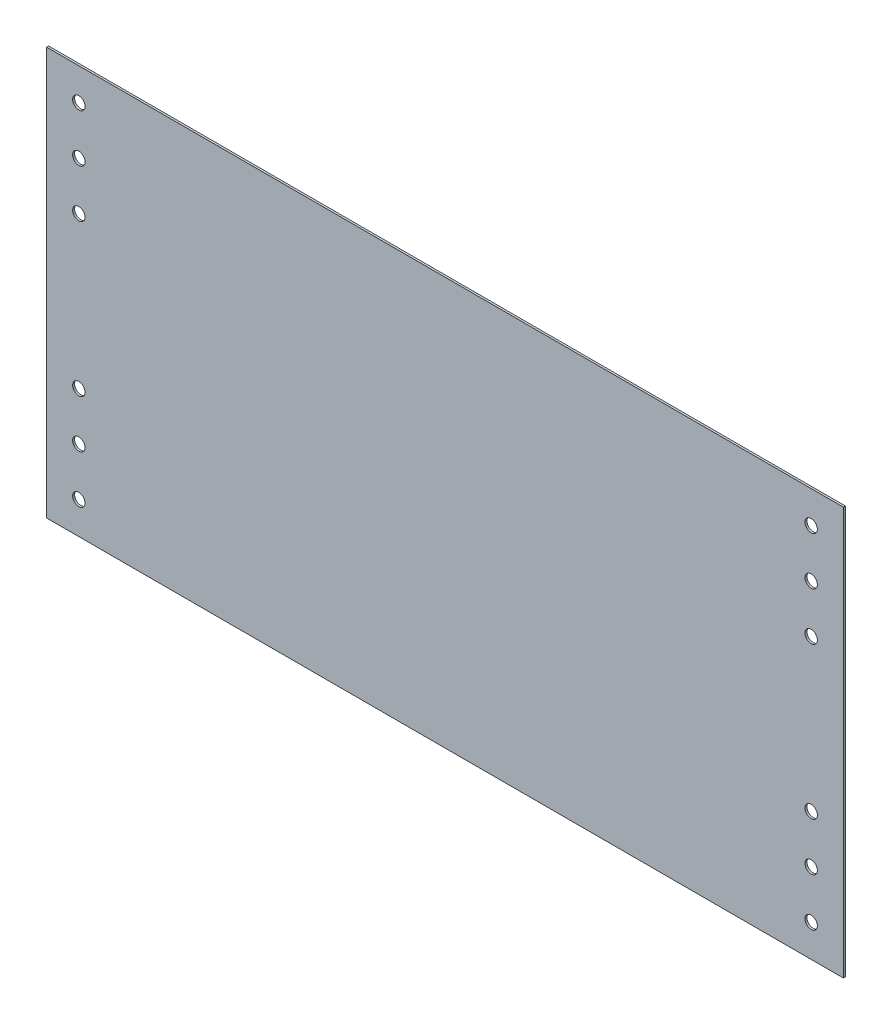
ISO-10303-21;
HEADER;
FILE_DESCRIPTION(('STEP AP214'),'2;1');
FILE_NAME('part.step','',(''),(''),'','','');
FILE_SCHEMA(('AUTOMOTIVE_DESIGN { 1 0 10303 214 1 1 1 1 }'));
ENDSEC;
DATA;
#1=APPLICATION_CONTEXT('core data for automotive mechanical design processes');
#2=APPLICATION_PROTOCOL_DEFINITION('international standard','automotive_design',2000,#1);
#3=PRODUCT_CONTEXT('',#1,'mechanical');
#4=PRODUCT('Part','Part','',(#3));
#5=PRODUCT_RELATED_PRODUCT_CATEGORY('part','',(#4));
#6=PRODUCT_DEFINITION_FORMATION('','',#4);
#7=PRODUCT_DEFINITION_CONTEXT('part definition',#1,'design');
#8=PRODUCT_DEFINITION('design','',#6,#7);
#9=PRODUCT_DEFINITION_SHAPE('','',#8);
#10=(LENGTH_UNIT() NAMED_UNIT(*) SI_UNIT(.MILLI.,.METRE.));
#11=(NAMED_UNIT(*) PLANE_ANGLE_UNIT() SI_UNIT($,.RADIAN.));
#12=(NAMED_UNIT(*) SI_UNIT($,.STERADIAN.) SOLID_ANGLE_UNIT());
#13=UNCERTAINTY_MEASURE_WITH_UNIT(LENGTH_MEASURE(1.E-05),#10,'distance_accuracy_value','');
#14=(GEOMETRIC_REPRESENTATION_CONTEXT(3) GLOBAL_UNCERTAINTY_ASSIGNED_CONTEXT((#13)) GLOBAL_UNIT_ASSIGNED_CONTEXT((#10,
#11,#12)) REPRESENTATION_CONTEXT('',''));
#15=CARTESIAN_POINT('',(0.,0.,0.));
#16=DIRECTION('',(0.,0.,1.));
#17=DIRECTION('',(1.,0.,0.));
#18=AXIS2_PLACEMENT_3D('',#15,#16,#17);
#19=CARTESIAN_POINT('',(-314.599113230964,343.044444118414,1.5875));
#20=DIRECTION('',(1.,0.,0.));
#21=DIRECTION('',(0.,1.,0.));
#22=AXIS2_PLACEMENT_3D('',#19,#20,#21);
#23=PLANE('',#22);
#24=DIRECTION('',(0.,-1.,0.));
#25=VECTOR('',#24,1.);
#26=CARTESIAN_POINT('',(-314.599113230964,343.044444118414,0.));
#27=LINE('',#26,#25);
#28=CARTESIAN_POINT('',(-314.599113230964,343.044444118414,0.));
#29=VERTEX_POINT('',#28);
#30=CARTESIAN_POINT('',(-314.599113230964,20.955,0.));
#31=VERTEX_POINT('',#30);
#32=EDGE_CURVE('E95',#29,#31,#27,.T.);
#33=ORIENTED_EDGE('',*,*,#32,.T.);
#34=DIRECTION('',(0.,0.,-1.));
#35=VECTOR('',#34,1.);
#36=CARTESIAN_POINT('',(-314.599113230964,20.955,1.5875));
#37=LINE('',#36,#35);
#38=CARTESIAN_POINT('',(-314.599113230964,20.955,1.5875));
#39=VERTEX_POINT('',#38);
#40=EDGE_CURVE('E11',#39,#31,#37,.T.);
#41=ORIENTED_EDGE('',*,*,#40,.F.);
#42=DIRECTION('',(0.,-1.,0.));
#43=VECTOR('',#42,1.);
#44=CARTESIAN_POINT('',(-314.599113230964,343.044444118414,1.5875));
#45=LINE('',#44,#43);
#46=CARTESIAN_POINT('',(-314.599113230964,343.044444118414,1.5875));
#47=VERTEX_POINT('',#46);
#48=EDGE_CURVE('E83',#47,#39,#45,.T.);
#49=ORIENTED_EDGE('',*,*,#48,.F.);
#50=DIRECTION('',(0.,0.,-1.));
#51=VECTOR('',#50,1.);
#52=CARTESIAN_POINT('',(-314.599113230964,343.044444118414,1.5875));
#53=LINE('',#52,#51);
#54=EDGE_CURVE('E91',#47,#29,#53,.T.);
#55=ORIENTED_EDGE('',*,*,#54,.T.);
#56=EDGE_LOOP('',(#33,#41,#49,#55));
#57=FACE_BOUND('',#56,.T.);
#58=ADVANCED_FACE('F32',(#57),#23,.F.);
#59=CARTESIAN_POINT('',(-314.599113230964,20.955,1.5875));
#60=DIRECTION('',(0.,1.,0.));
#61=DIRECTION('',(0.,0.,1.));
#62=AXIS2_PLACEMENT_3D('',#59,#60,#61);
#63=PLANE('',#62);
#64=DIRECTION('',(1.,0.,0.));
#65=VECTOR('',#64,1.);
#66=CARTESIAN_POINT('',(-314.599113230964,20.955,0.));
#67=LINE('',#66,#65);
#68=CARTESIAN_POINT('',(314.599113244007,20.955,0.));
#69=VERTEX_POINT('',#68);
#70=EDGE_CURVE('E87',#31,#69,#67,.T.);
#71=ORIENTED_EDGE('',*,*,#70,.T.);
#72=DIRECTION('',(0.,0.,-1.));
#73=VECTOR('',#72,1.);
#74=CARTESIAN_POINT('',(314.599113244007,20.955,1.5875));
#75=LINE('',#74,#73);
#76=CARTESIAN_POINT('',(314.599113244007,20.955,1.5875));
#77=VERTEX_POINT('',#76);
#78=EDGE_CURVE('E40',#77,#69,#75,.T.);
#79=ORIENTED_EDGE('',*,*,#78,.F.);
#80=DIRECTION('',(1.,0.,0.));
#81=VECTOR('',#80,1.);
#82=CARTESIAN_POINT('',(-314.599113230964,20.955,1.5875));
#83=LINE('',#82,#81);
#84=EDGE_CURVE('E78',#39,#77,#83,.T.);
#85=ORIENTED_EDGE('',*,*,#84,.F.);
#86=ORIENTED_EDGE('',*,*,#40,.T.);
#87=EDGE_LOOP('',(#71,#79,#85,#86));
#88=FACE_BOUND('',#87,.T.);
#89=ADVANCED_FACE('F86',(#88),#63,.F.);
#90=CARTESIAN_POINT('',(314.599113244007,343.044444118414,1.5875));
#91=DIRECTION('',(-1.,0.,0.));
#92=DIRECTION('',(0.,-1.,0.));
#93=AXIS2_PLACEMENT_3D('',#90,#91,#92);
#94=PLANE('',#93);
#95=DIRECTION('',(0.,1.,0.));
#96=VECTOR('',#95,1.);
#97=CARTESIAN_POINT('',(314.599113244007,343.044444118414,0.));
#98=LINE('',#97,#96);
#99=CARTESIAN_POINT('',(314.599113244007,343.044444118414,0.));
#100=VERTEX_POINT('',#99);
#101=EDGE_CURVE('E65',#69,#100,#98,.T.);
#102=ORIENTED_EDGE('',*,*,#101,.T.);
#103=DIRECTION('',(0.,0.,-1.));
#104=VECTOR('',#103,1.);
#105=CARTESIAN_POINT('',(314.599113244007,343.044444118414,1.5875));
#106=LINE('',#105,#104);
#107=CARTESIAN_POINT('',(314.599113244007,343.044444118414,1.5875));
#108=VERTEX_POINT('',#107);
#109=EDGE_CURVE('E88',#108,#100,#106,.T.);
#110=ORIENTED_EDGE('',*,*,#109,.F.);
#111=DIRECTION('',(0.,1.,0.));
#112=VECTOR('',#111,1.);
#113=CARTESIAN_POINT('',(314.599113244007,343.044444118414,1.5875));
#114=LINE('',#113,#112);
#115=EDGE_CURVE('E81',#77,#108,#114,.T.);
#116=ORIENTED_EDGE('',*,*,#115,.F.);
#117=ORIENTED_EDGE('',*,*,#78,.T.);
#118=EDGE_LOOP('',(#102,#110,#116,#117));
#119=FACE_BOUND('',#118,.T.);
#120=ADVANCED_FACE('F89',(#119),#94,.F.);
#121=CARTESIAN_POINT('',(-314.599113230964,343.044444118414,1.5875));
#122=DIRECTION('',(0.,-1.,0.));
#123=DIRECTION('',(0.,0.,-1.));
#124=AXIS2_PLACEMENT_3D('',#121,#122,#123);
#125=PLANE('',#124);
#126=DIRECTION('',(-1.,0.,0.));
#127=VECTOR('',#126,1.);
#128=CARTESIAN_POINT('',(-314.599113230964,343.044444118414,0.));
#129=LINE('',#128,#127);
#130=EDGE_CURVE('E71',#100,#29,#129,.T.);
#131=ORIENTED_EDGE('',*,*,#130,.T.);
#132=ORIENTED_EDGE('',*,*,#54,.F.);
#133=DIRECTION('',(-1.,0.,0.));
#134=VECTOR('',#133,1.);
#135=CARTESIAN_POINT('',(-314.599113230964,343.044444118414,1.5875));
#136=LINE('',#135,#134);
#137=EDGE_CURVE('E48',#108,#47,#136,.T.);
#138=ORIENTED_EDGE('',*,*,#137,.F.);
#139=ORIENTED_EDGE('',*,*,#109,.T.);
#140=EDGE_LOOP('',(#131,#132,#138,#139));
#141=FACE_BOUND('',#140,.T.);
#142=ADVANCED_FACE('F103',(#141),#125,.F.);
#143=CARTESIAN_POINT('',(0.,0.,1.5875));
#144=DIRECTION('',(0.,0.,1.));
#145=DIRECTION('',(1.,0.,0.));
#146=AXIS2_PLACEMENT_3D('',#143,#144,#145);
#147=PLANE('',#146);
#148=CARTESIAN_POINT('',(-289.199113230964,46.355,1.5875));
#149=DIRECTION('',(0.,0.,1.));
#150=DIRECTION('',(1.,0.,0.));
#151=AXIS2_PLACEMENT_3D('',#148,#149,#150);
#152=CIRCLE('',#151,4.9022);
#153=CARTESIAN_POINT('',(-284.296913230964,46.355,1.5875));
#154=VERTEX_POINT('',#153);
#155=EDGE_CURVE('E142',#154,#154,#152,.T.);
#156=ORIENTED_EDGE('',*,*,#155,.F.);
#157=EDGE_LOOP('',(#156));
#158=FACE_BOUND('',#157,.T.);
#159=CARTESIAN_POINT('',(-289.199113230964,84.2544736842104,1.5875));
#160=DIRECTION('',(0.,0.,1.));
#161=DIRECTION('',(1.,0.,0.));
#162=AXIS2_PLACEMENT_3D('',#159,#160,#161);
#163=CIRCLE('',#162,4.9022);
#164=CARTESIAN_POINT('',(-284.296913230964,84.2544736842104,1.5875));
#165=VERTEX_POINT('',#164);
#166=EDGE_CURVE('E149',#165,#165,#163,.T.);
#167=ORIENTED_EDGE('',*,*,#166,.F.);
#168=EDGE_LOOP('',(#167));
#169=FACE_BOUND('',#168,.T.);
#170=CARTESIAN_POINT('',(-289.199113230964,122.153947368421,1.5875));
#171=DIRECTION('',(0.,0.,1.));
#172=DIRECTION('',(1.,0.,0.));
#173=AXIS2_PLACEMENT_3D('',#170,#171,#172);
#174=CIRCLE('',#173,4.9022);
#175=CARTESIAN_POINT('',(-284.296913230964,122.153947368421,1.5875));
#176=VERTEX_POINT('',#175);
#177=EDGE_CURVE('E155',#176,#176,#174,.T.);
#178=ORIENTED_EDGE('',*,*,#177,.F.);
#179=EDGE_LOOP('',(#178));
#180=FACE_BOUND('',#179,.T.);
#181=CARTESIAN_POINT('',(289.199113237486,241.845496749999,1.5875));
#182=DIRECTION('',(0.,0.,1.));
#183=DIRECTION('',(1.,0.,0.));
#184=AXIS2_PLACEMENT_3D('',#181,#182,#183);
#185=CIRCLE('',#184,4.9022);
#186=CARTESIAN_POINT('',(294.101313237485,241.845496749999,1.5875));
#187=VERTEX_POINT('',#186);
#188=EDGE_CURVE('E119',#187,#187,#185,.T.);
#189=ORIENTED_EDGE('',*,*,#188,.F.);
#190=EDGE_LOOP('',(#189));
#191=FACE_BOUND('',#190,.T.);
#192=CARTESIAN_POINT('',(289.199113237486,279.74497043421,1.5875));
#193=DIRECTION('',(0.,0.,1.));
#194=DIRECTION('',(1.,0.,0.));
#195=AXIS2_PLACEMENT_3D('',#192,#193,#194);
#196=CIRCLE('',#195,4.9022);
#197=CARTESIAN_POINT('',(294.101313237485,279.74497043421,1.5875));
#198=VERTEX_POINT('',#197);
#199=EDGE_CURVE('E118',#198,#198,#196,.T.);
#200=ORIENTED_EDGE('',*,*,#199,.F.);
#201=EDGE_LOOP('',(#200));
#202=FACE_BOUND('',#201,.T.);
#203=CARTESIAN_POINT('',(289.199113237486,317.64444411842,1.5875));
#204=DIRECTION('',(0.,0.,1.));
#205=DIRECTION('',(1.,0.,0.));
#206=AXIS2_PLACEMENT_3D('',#203,#204,#205);
#207=CIRCLE('',#206,4.9022);
#208=CARTESIAN_POINT('',(294.101313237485,317.64444411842,1.5875));
#209=VERTEX_POINT('',#208);
#210=EDGE_CURVE('E125',#209,#209,#207,.T.);
#211=ORIENTED_EDGE('',*,*,#210,.F.);
#212=EDGE_LOOP('',(#211));
#213=FACE_BOUND('',#212,.T.);
#214=CARTESIAN_POINT('',(-289.199113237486,241.845496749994,1.5875));
#215=DIRECTION('',(0.,0.,1.));
#216=DIRECTION('',(1.,0.,0.));
#217=AXIS2_PLACEMENT_3D('',#214,#215,#216);
#218=CIRCLE('',#217,4.9022);
#219=CARTESIAN_POINT('',(-284.296913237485,241.845496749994,1.5875));
#220=VERTEX_POINT('',#219);
#221=EDGE_CURVE('E131',#220,#220,#218,.T.);
#222=ORIENTED_EDGE('',*,*,#221,.F.);
#223=EDGE_LOOP('',(#222));
#224=FACE_BOUND('',#223,.T.);
#225=CARTESIAN_POINT('',(-289.199113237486,279.744970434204,1.5875));
#226=DIRECTION('',(0.,0.,1.));
#227=DIRECTION('',(1.,0.,0.));
#228=AXIS2_PLACEMENT_3D('',#225,#226,#227);
#229=CIRCLE('',#228,4.9022);
#230=CARTESIAN_POINT('',(-284.296913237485,279.744970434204,1.5875));
#231=VERTEX_POINT('',#230);
#232=EDGE_CURVE('E112',#231,#231,#229,.T.);
#233=ORIENTED_EDGE('',*,*,#232,.F.);
#234=EDGE_LOOP('',(#233));
#235=FACE_BOUND('',#234,.T.);
#236=CARTESIAN_POINT('',(289.199113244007,122.153947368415,1.5875));
#237=DIRECTION('',(0.,0.,1.));
#238=DIRECTION('',(1.,0.,0.));
#239=AXIS2_PLACEMENT_3D('',#236,#237,#238);
#240=CIRCLE('',#239,4.9022);
#241=CARTESIAN_POINT('',(294.101313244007,122.153947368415,1.5875));
#242=VERTEX_POINT('',#241);
#243=EDGE_CURVE('E143',#242,#242,#240,.T.);
#244=ORIENTED_EDGE('',*,*,#243,.F.);
#245=EDGE_LOOP('',(#244));
#246=FACE_BOUND('',#245,.T.);
#247=CARTESIAN_POINT('',(289.199113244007,84.2544736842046,1.5875));
#248=DIRECTION('',(0.,0.,1.));
#249=DIRECTION('',(1.,0.,0.));
#250=AXIS2_PLACEMENT_3D('',#247,#248,#249);
#251=CIRCLE('',#250,4.9022);
#252=CARTESIAN_POINT('',(294.101313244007,84.2544736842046,1.5875));
#253=VERTEX_POINT('',#252);
#254=EDGE_CURVE('E172',#253,#253,#251,.T.);
#255=ORIENTED_EDGE('',*,*,#254,.F.);
#256=EDGE_LOOP('',(#255));
#257=FACE_BOUND('',#256,.T.);
#258=CARTESIAN_POINT('',(289.199113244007,46.3549999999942,1.5875));
#259=DIRECTION('',(0.,0.,1.));
#260=DIRECTION('',(1.,0.,0.));
#261=AXIS2_PLACEMENT_3D('',#258,#259,#260);
#262=CIRCLE('',#261,4.9022);
#263=CARTESIAN_POINT('',(294.101313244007,46.3549999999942,1.5875));
#264=VERTEX_POINT('',#263);
#265=EDGE_CURVE('E166',#264,#264,#262,.T.);
#266=ORIENTED_EDGE('',*,*,#265,.F.);
#267=EDGE_LOOP('',(#266));
#268=FACE_BOUND('',#267,.T.);
#269=CARTESIAN_POINT('',(-289.199113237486,317.644444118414,1.5875));
#270=DIRECTION('',(0.,0.,1.));
#271=DIRECTION('',(1.,0.,0.));
#272=AXIS2_PLACEMENT_3D('',#269,#270,#271);
#273=CIRCLE('',#272,4.9022);
#274=CARTESIAN_POINT('',(-284.296913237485,317.644444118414,1.5875));
#275=VERTEX_POINT('',#274);
#276=EDGE_CURVE('E98',#275,#275,#273,.T.);
#277=ORIENTED_EDGE('',*,*,#276,.F.);
#278=EDGE_LOOP('',(#277));
#279=FACE_BOUND('',#278,.T.);
#280=ORIENTED_EDGE('',*,*,#48,.T.);
#281=ORIENTED_EDGE('',*,*,#84,.T.);
#282=ORIENTED_EDGE('',*,*,#115,.T.);
#283=ORIENTED_EDGE('',*,*,#137,.T.);
#284=EDGE_LOOP('',(#280,#281,#282,#283));
#285=FACE_BOUND('',#284,.T.);
#286=ADVANCED_FACE('F79',(#158,#169,#180,#191,#202,#213,#224,#235,#246,#257,#268,#279,#285),
#147,.T.);
#287=CARTESIAN_POINT('',(0.,0.,0.));
#288=DIRECTION('',(0.,0.,1.));
#289=DIRECTION('',(1.,0.,0.));
#290=AXIS2_PLACEMENT_3D('',#287,#288,#289);
#291=PLANE('',#290);
#292=CARTESIAN_POINT('',(-289.199113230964,46.355,0.));
#293=DIRECTION('',(0.,0.,1.));
#294=DIRECTION('',(1.,0.,0.));
#295=AXIS2_PLACEMENT_3D('',#292,#293,#294);
#296=CIRCLE('',#295,4.9022);
#297=CARTESIAN_POINT('',(-284.296913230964,46.355,0.));
#298=VERTEX_POINT('',#297);
#299=EDGE_CURVE('E139',#298,#298,#296,.T.);
#300=ORIENTED_EDGE('',*,*,#299,.T.);
#301=EDGE_LOOP('',(#300));
#302=FACE_BOUND('',#301,.T.);
#303=CARTESIAN_POINT('',(-289.199113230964,84.2544736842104,0.));
#304=DIRECTION('',(0.,0.,1.));
#305=DIRECTION('',(1.,0.,0.));
#306=AXIS2_PLACEMENT_3D('',#303,#304,#305);
#307=CIRCLE('',#306,4.9022);
#308=CARTESIAN_POINT('',(-284.296913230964,84.2544736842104,0.));
#309=VERTEX_POINT('',#308);
#310=EDGE_CURVE('E146',#309,#309,#307,.T.);
#311=ORIENTED_EDGE('',*,*,#310,.T.);
#312=EDGE_LOOP('',(#311));
#313=FACE_BOUND('',#312,.T.);
#314=CARTESIAN_POINT('',(-289.199113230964,122.153947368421,0.));
#315=DIRECTION('',(0.,0.,1.));
#316=DIRECTION('',(1.,0.,0.));
#317=AXIS2_PLACEMENT_3D('',#314,#315,#316);
#318=CIRCLE('',#317,4.9022);
#319=CARTESIAN_POINT('',(-284.296913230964,122.153947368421,0.));
#320=VERTEX_POINT('',#319);
#321=EDGE_CURVE('E152',#320,#320,#318,.T.);
#322=ORIENTED_EDGE('',*,*,#321,.T.);
#323=EDGE_LOOP('',(#322));
#324=FACE_BOUND('',#323,.T.);
#325=CARTESIAN_POINT('',(289.199113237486,241.845496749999,0.));
#326=DIRECTION('',(0.,0.,1.));
#327=DIRECTION('',(1.,0.,0.));
#328=AXIS2_PLACEMENT_3D('',#325,#326,#327);
#329=CIRCLE('',#328,4.9022);
#330=CARTESIAN_POINT('',(294.101313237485,241.845496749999,0.));
#331=VERTEX_POINT('',#330);
#332=EDGE_CURVE('E158',#331,#331,#329,.T.);
#333=ORIENTED_EDGE('',*,*,#332,.T.);
#334=EDGE_LOOP('',(#333));
#335=FACE_BOUND('',#334,.T.);
#336=CARTESIAN_POINT('',(289.199113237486,279.74497043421,0.));
#337=DIRECTION('',(0.,0.,1.));
#338=DIRECTION('',(1.,0.,0.));
#339=AXIS2_PLACEMENT_3D('',#336,#337,#338);
#340=CIRCLE('',#339,4.9022);
#341=CARTESIAN_POINT('',(294.101313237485,279.74497043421,0.));
#342=VERTEX_POINT('',#341);
#343=EDGE_CURVE('E115',#342,#342,#340,.T.);
#344=ORIENTED_EDGE('',*,*,#343,.T.);
#345=EDGE_LOOP('',(#344));
#346=FACE_BOUND('',#345,.T.);
#347=CARTESIAN_POINT('',(289.199113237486,317.64444411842,0.));
#348=DIRECTION('',(0.,0.,1.));
#349=DIRECTION('',(1.,0.,0.));
#350=AXIS2_PLACEMENT_3D('',#347,#348,#349);
#351=CIRCLE('',#350,4.9022);
#352=CARTESIAN_POINT('',(294.101313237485,317.64444411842,0.));
#353=VERTEX_POINT('',#352);
#354=EDGE_CURVE('E122',#353,#353,#351,.T.);
#355=ORIENTED_EDGE('',*,*,#354,.T.);
#356=EDGE_LOOP('',(#355));
#357=FACE_BOUND('',#356,.T.);
#358=CARTESIAN_POINT('',(-289.199113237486,241.845496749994,0.));
#359=DIRECTION('',(0.,0.,1.));
#360=DIRECTION('',(1.,0.,0.));
#361=AXIS2_PLACEMENT_3D('',#358,#359,#360);
#362=CIRCLE('',#361,4.9022);
#363=CARTESIAN_POINT('',(-284.296913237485,241.845496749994,0.));
#364=VERTEX_POINT('',#363);
#365=EDGE_CURVE('E128',#364,#364,#362,.T.);
#366=ORIENTED_EDGE('',*,*,#365,.T.);
#367=EDGE_LOOP('',(#366));
#368=FACE_BOUND('',#367,.T.);
#369=CARTESIAN_POINT('',(-289.199113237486,279.744970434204,0.));
#370=DIRECTION('',(0.,0.,1.));
#371=DIRECTION('',(1.,0.,0.));
#372=AXIS2_PLACEMENT_3D('',#369,#370,#371);
#373=CIRCLE('',#372,4.9022);
#374=CARTESIAN_POINT('',(-284.296913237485,279.744970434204,0.));
#375=VERTEX_POINT('',#374);
#376=EDGE_CURVE('E134',#375,#375,#373,.T.);
#377=ORIENTED_EDGE('',*,*,#376,.T.);
#378=EDGE_LOOP('',(#377));
#379=FACE_BOUND('',#378,.T.);
#380=CARTESIAN_POINT('',(289.199113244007,122.153947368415,0.));
#381=DIRECTION('',(0.,0.,1.));
#382=DIRECTION('',(1.,0.,0.));
#383=AXIS2_PLACEMENT_3D('',#380,#381,#382);
#384=CIRCLE('',#383,4.9022);
#385=CARTESIAN_POINT('',(294.101313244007,122.153947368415,0.));
#386=VERTEX_POINT('',#385);
#387=EDGE_CURVE('E175',#386,#386,#384,.T.);
#388=ORIENTED_EDGE('',*,*,#387,.T.);
#389=EDGE_LOOP('',(#388));
#390=FACE_BOUND('',#389,.T.);
#391=CARTESIAN_POINT('',(289.199113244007,84.2544736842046,0.));
#392=DIRECTION('',(0.,0.,1.));
#393=DIRECTION('',(1.,0.,0.));
#394=AXIS2_PLACEMENT_3D('',#391,#392,#393);
#395=CIRCLE('',#394,4.9022);
#396=CARTESIAN_POINT('',(294.101313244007,84.2544736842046,0.));
#397=VERTEX_POINT('',#396);
#398=EDGE_CURVE('E169',#397,#397,#395,.T.);
#399=ORIENTED_EDGE('',*,*,#398,.T.);
#400=EDGE_LOOP('',(#399));
#401=FACE_BOUND('',#400,.T.);
#402=CARTESIAN_POINT('',(289.199113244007,46.3549999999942,0.));
#403=DIRECTION('',(0.,0.,1.));
#404=DIRECTION('',(1.,0.,0.));
#405=AXIS2_PLACEMENT_3D('',#402,#403,#404);
#406=CIRCLE('',#405,4.9022);
#407=CARTESIAN_POINT('',(294.101313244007,46.3549999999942,0.));
#408=VERTEX_POINT('',#407);
#409=EDGE_CURVE('E163',#408,#408,#406,.T.);
#410=ORIENTED_EDGE('',*,*,#409,.T.);
#411=EDGE_LOOP('',(#410));
#412=FACE_BOUND('',#411,.T.);
#413=CARTESIAN_POINT('',(-289.199113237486,317.644444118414,0.));
#414=DIRECTION('',(0.,0.,1.));
#415=DIRECTION('',(1.,0.,0.));
#416=AXIS2_PLACEMENT_3D('',#413,#414,#415);
#417=CIRCLE('',#416,4.9022);
#418=CARTESIAN_POINT('',(-284.296913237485,317.644444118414,0.));
#419=VERTEX_POINT('',#418);
#420=EDGE_CURVE('E109',#419,#419,#417,.T.);
#421=ORIENTED_EDGE('',*,*,#420,.T.);
#422=EDGE_LOOP('',(#421));
#423=FACE_BOUND('',#422,.T.);
#424=ORIENTED_EDGE('',*,*,#32,.F.);
#425=ORIENTED_EDGE('',*,*,#130,.F.);
#426=ORIENTED_EDGE('',*,*,#101,.F.);
#427=ORIENTED_EDGE('',*,*,#70,.F.);
#428=EDGE_LOOP('',(#424,#425,#426,#427));
#429=FACE_BOUND('',#428,.T.);
#430=ADVANCED_FACE('F106',(#302,#313,#324,#335,#346,#357,#368,#379,#390,#401,#412,#423,#429),
#291,.F.);
#431=CARTESIAN_POINT('',(-289.199113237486,317.644444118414,1.5875));
#432=DIRECTION('',(0.,0.,-1.));
#433=DIRECTION('',(-1.,0.,0.));
#434=AXIS2_PLACEMENT_3D('',#431,#432,#433);
#435=CYLINDRICAL_SURFACE('',#434,4.9022);
#436=ORIENTED_EDGE('',*,*,#276,.T.);
#437=EDGE_LOOP('',(#436));
#438=FACE_BOUND('',#437,.T.);
#439=ORIENTED_EDGE('',*,*,#420,.F.);
#440=EDGE_LOOP('',(#439));
#441=FACE_BOUND('',#440,.T.);
#442=ADVANCED_FACE('F194',(#438,#441),#435,.F.);
#443=CARTESIAN_POINT('',(289.199113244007,46.3549999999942,1.5875));
#444=DIRECTION('',(0.,0.,-1.));
#445=DIRECTION('',(-1.,0.,0.));
#446=AXIS2_PLACEMENT_3D('',#443,#444,#445);
#447=CYLINDRICAL_SURFACE('',#446,4.9022);
#448=ORIENTED_EDGE('',*,*,#265,.T.);
#449=EDGE_LOOP('',(#448));
#450=FACE_BOUND('',#449,.T.);
#451=ORIENTED_EDGE('',*,*,#409,.F.);
#452=EDGE_LOOP('',(#451));
#453=FACE_BOUND('',#452,.T.);
#454=ADVANCED_FACE('F197',(#450,#453),#447,.F.);
#455=CARTESIAN_POINT('',(289.199113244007,84.2544736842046,1.5875));
#456=DIRECTION('',(0.,0.,-1.));
#457=DIRECTION('',(-1.,0.,0.));
#458=AXIS2_PLACEMENT_3D('',#455,#456,#457);
#459=CYLINDRICAL_SURFACE('',#458,4.9022);
#460=ORIENTED_EDGE('',*,*,#254,.T.);
#461=EDGE_LOOP('',(#460));
#462=FACE_BOUND('',#461,.T.);
#463=ORIENTED_EDGE('',*,*,#398,.F.);
#464=EDGE_LOOP('',(#463));
#465=FACE_BOUND('',#464,.T.);
#466=ADVANCED_FACE('F244',(#462,#465),#459,.F.);
#467=CARTESIAN_POINT('',(289.199113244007,122.153947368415,1.5875));
#468=DIRECTION('',(0.,0.,-1.));
#469=DIRECTION('',(-1.,0.,0.));
#470=AXIS2_PLACEMENT_3D('',#467,#468,#469);
#471=CYLINDRICAL_SURFACE('',#470,4.9022);
#472=ORIENTED_EDGE('',*,*,#243,.T.);
#473=EDGE_LOOP('',(#472));
#474=FACE_BOUND('',#473,.T.);
#475=ORIENTED_EDGE('',*,*,#387,.F.);
#476=EDGE_LOOP('',(#475));
#477=FACE_BOUND('',#476,.T.);
#478=ADVANCED_FACE('F181',(#474,#477),#471,.F.);
#479=CARTESIAN_POINT('',(-289.199113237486,279.744970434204,1.5875));
#480=DIRECTION('',(0.,0.,-1.));
#481=DIRECTION('',(-1.,0.,0.));
#482=AXIS2_PLACEMENT_3D('',#479,#480,#481);
#483=CYLINDRICAL_SURFACE('',#482,4.9022);
#484=ORIENTED_EDGE('',*,*,#232,.T.);
#485=EDGE_LOOP('',(#484));
#486=FACE_BOUND('',#485,.T.);
#487=ORIENTED_EDGE('',*,*,#376,.F.);
#488=EDGE_LOOP('',(#487));
#489=FACE_BOUND('',#488,.T.);
#490=ADVANCED_FACE('F263',(#486,#489),#483,.F.);
#491=CARTESIAN_POINT('',(-289.199113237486,241.845496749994,1.5875));
#492=DIRECTION('',(0.,0.,-1.));
#493=DIRECTION('',(-1.,0.,0.));
#494=AXIS2_PLACEMENT_3D('',#491,#492,#493);
#495=CYLINDRICAL_SURFACE('',#494,4.9022);
#496=ORIENTED_EDGE('',*,*,#221,.T.);
#497=EDGE_LOOP('',(#496));
#498=FACE_BOUND('',#497,.T.);
#499=ORIENTED_EDGE('',*,*,#365,.F.);
#500=EDGE_LOOP('',(#499));
#501=FACE_BOUND('',#500,.T.);
#502=ADVANCED_FACE('F272',(#498,#501),#495,.F.);
#503=CARTESIAN_POINT('',(289.199113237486,317.64444411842,1.5875));
#504=DIRECTION('',(0.,0.,-1.));
#505=DIRECTION('',(-1.,0.,0.));
#506=AXIS2_PLACEMENT_3D('',#503,#504,#505);
#507=CYLINDRICAL_SURFACE('',#506,4.9022);
#508=ORIENTED_EDGE('',*,*,#210,.T.);
#509=EDGE_LOOP('',(#508));
#510=FACE_BOUND('',#509,.T.);
#511=ORIENTED_EDGE('',*,*,#354,.F.);
#512=EDGE_LOOP('',(#511));
#513=FACE_BOUND('',#512,.T.);
#514=ADVANCED_FACE('F282',(#510,#513),#507,.F.);
#515=CARTESIAN_POINT('',(289.199113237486,279.74497043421,1.5875));
#516=DIRECTION('',(0.,0.,-1.));
#517=DIRECTION('',(-1.,0.,0.));
#518=AXIS2_PLACEMENT_3D('',#515,#516,#517);
#519=CYLINDRICAL_SURFACE('',#518,4.9022);
#520=ORIENTED_EDGE('',*,*,#199,.T.);
#521=EDGE_LOOP('',(#520));
#522=FACE_BOUND('',#521,.T.);
#523=ORIENTED_EDGE('',*,*,#343,.F.);
#524=EDGE_LOOP('',(#523));
#525=FACE_BOUND('',#524,.T.);
#526=ADVANCED_FACE('F292',(#522,#525),#519,.F.);
#527=CARTESIAN_POINT('',(289.199113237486,241.845496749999,1.5875));
#528=DIRECTION('',(0.,0.,-1.));
#529=DIRECTION('',(-1.,0.,0.));
#530=AXIS2_PLACEMENT_3D('',#527,#528,#529);
#531=CYLINDRICAL_SURFACE('',#530,4.9022);
#532=ORIENTED_EDGE('',*,*,#188,.T.);
#533=EDGE_LOOP('',(#532));
#534=FACE_BOUND('',#533,.T.);
#535=ORIENTED_EDGE('',*,*,#332,.F.);
#536=EDGE_LOOP('',(#535));
#537=FACE_BOUND('',#536,.T.);
#538=ADVANCED_FACE('F302',(#534,#537),#531,.F.);
#539=CARTESIAN_POINT('',(-289.199113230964,122.153947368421,1.5875));
#540=DIRECTION('',(0.,0.,-1.));
#541=DIRECTION('',(-1.,0.,0.));
#542=AXIS2_PLACEMENT_3D('',#539,#540,#541);
#543=CYLINDRICAL_SURFACE('',#542,4.9022);
#544=ORIENTED_EDGE('',*,*,#177,.T.);
#545=EDGE_LOOP('',(#544));
#546=FACE_BOUND('',#545,.T.);
#547=ORIENTED_EDGE('',*,*,#321,.F.);
#548=EDGE_LOOP('',(#547));
#549=FACE_BOUND('',#548,.T.);
#550=ADVANCED_FACE('F312',(#546,#549),#543,.F.);
#551=CARTESIAN_POINT('',(-289.199113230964,84.2544736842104,1.5875));
#552=DIRECTION('',(0.,0.,-1.));
#553=DIRECTION('',(-1.,0.,0.));
#554=AXIS2_PLACEMENT_3D('',#551,#552,#553);
#555=CYLINDRICAL_SURFACE('',#554,4.9022);
#556=ORIENTED_EDGE('',*,*,#166,.T.);
#557=EDGE_LOOP('',(#556));
#558=FACE_BOUND('',#557,.T.);
#559=ORIENTED_EDGE('',*,*,#310,.F.);
#560=EDGE_LOOP('',(#559));
#561=FACE_BOUND('',#560,.T.);
#562=ADVANCED_FACE('F322',(#558,#561),#555,.F.);
#563=CARTESIAN_POINT('',(-289.199113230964,46.355,1.5875));
#564=DIRECTION('',(0.,0.,-1.));
#565=DIRECTION('',(-1.,0.,0.));
#566=AXIS2_PLACEMENT_3D('',#563,#564,#565);
#567=CYLINDRICAL_SURFACE('',#566,4.9022);
#568=ORIENTED_EDGE('',*,*,#155,.T.);
#569=EDGE_LOOP('',(#568));
#570=FACE_BOUND('',#569,.T.);
#571=ORIENTED_EDGE('',*,*,#299,.F.);
#572=EDGE_LOOP('',(#571));
#573=FACE_BOUND('',#572,.T.);
#574=ADVANCED_FACE('F332',(#570,#573),#567,.F.);
#575=CLOSED_SHELL('',(#58,#89,#120,#142,#286,#430,#442,#454,#466,#478,#490,#502,#514,#526,#538,
#550,#562,#574));
#576=MANIFOLD_SOLID_BREP('B2',#575);
#577=ADVANCED_BREP_SHAPE_REPRESENTATION('',(#18,#576),#14);
#578=SHAPE_DEFINITION_REPRESENTATION(#9,#577);
ENDSEC;
END-ISO-10303-21;
